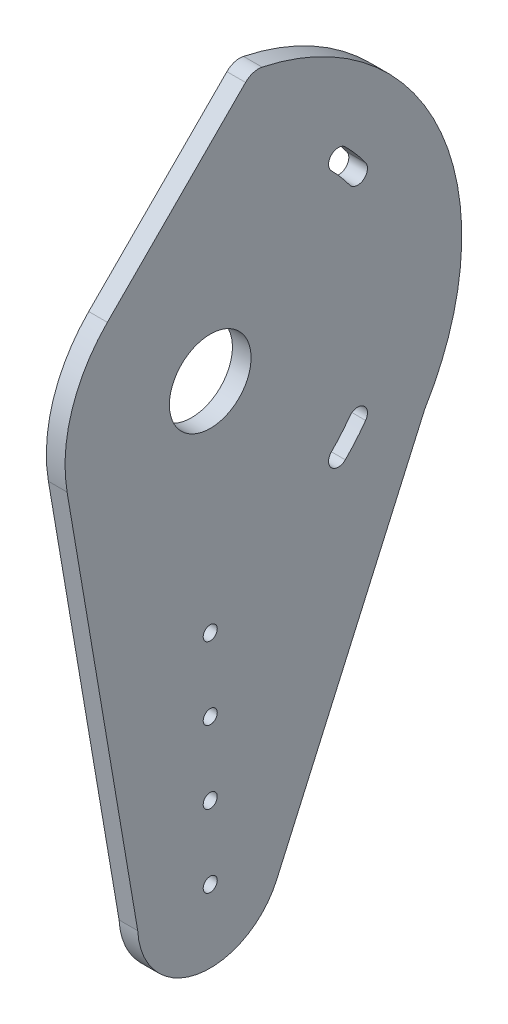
ISO-10303-21;
HEADER;
FILE_DESCRIPTION(('STEP AP214'),'2;1');
FILE_NAME('part.step','',(''),(''),'','','');
FILE_SCHEMA(('AUTOMOTIVE_DESIGN { 1 0 10303 214 1 1 1 1 }'));
ENDSEC;
DATA;
#1=APPLICATION_CONTEXT('core data for automotive mechanical design processes');
#2=APPLICATION_PROTOCOL_DEFINITION('international standard','automotive_design',2000,#1);
#3=PRODUCT_CONTEXT('',#1,'mechanical');
#4=PRODUCT('Part','Part','',(#3));
#5=PRODUCT_RELATED_PRODUCT_CATEGORY('part','',(#4));
#6=PRODUCT_DEFINITION_FORMATION('','',#4);
#7=PRODUCT_DEFINITION_CONTEXT('part definition',#1,'design');
#8=PRODUCT_DEFINITION('design','',#6,#7);
#9=PRODUCT_DEFINITION_SHAPE('','',#8);
#10=(LENGTH_UNIT() NAMED_UNIT(*) SI_UNIT(.MILLI.,.METRE.));
#11=(NAMED_UNIT(*) PLANE_ANGLE_UNIT() SI_UNIT($,.RADIAN.));
#12=(NAMED_UNIT(*) SI_UNIT($,.STERADIAN.) SOLID_ANGLE_UNIT());
#13=UNCERTAINTY_MEASURE_WITH_UNIT(LENGTH_MEASURE(1.E-05),#10,'distance_accuracy_value','');
#14=(GEOMETRIC_REPRESENTATION_CONTEXT(3) GLOBAL_UNCERTAINTY_ASSIGNED_CONTEXT((#13)) GLOBAL_UNIT_ASSIGNED_CONTEXT((#10,
#11,#12)) REPRESENTATION_CONTEXT('',''));
#15=CARTESIAN_POINT('',(0.,0.,0.));
#16=DIRECTION('',(0.,0.,1.));
#17=DIRECTION('',(1.,0.,0.));
#18=AXIS2_PLACEMENT_3D('',#15,#16,#17);
#19=CARTESIAN_POINT('',(6.5278,0.,0.));
#20=DIRECTION('',(1.,0.,0.));
#21=DIRECTION('',(0.,0.,-1.));
#22=AXIS2_PLACEMENT_3D('',#19,#20,#21);
#23=PLANE('',#22);
#24=CARTESIAN_POINT('',(6.5278,-152.4,0.));
#25=DIRECTION('',(1.,0.,0.));
#26=DIRECTION('',(0.,0.,-1.));
#27=AXIS2_PLACEMENT_3D('',#24,#25,#26);
#28=CIRCLE('',#27,2.45745);
#29=CARTESIAN_POINT('',(6.5278,-152.4,-2.45745000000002));
#30=VERTEX_POINT('',#29);
#31=EDGE_CURVE('E514',#30,#30,#28,.T.);
#32=ORIENTED_EDGE('',*,*,#31,.F.);
#33=EDGE_LOOP('',(#32));
#34=FACE_BOUND('',#33,.T.);
#35=CARTESIAN_POINT('',(6.5278,-127.,0.));
#36=DIRECTION('',(1.,0.,0.));
#37=DIRECTION('',(0.,0.,-1.));
#38=AXIS2_PLACEMENT_3D('',#35,#36,#37);
#39=CIRCLE('',#38,2.45745);
#40=CARTESIAN_POINT('',(6.5278,-127.,-2.45745000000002));
#41=VERTEX_POINT('',#40);
#42=EDGE_CURVE('E506',#41,#41,#39,.T.);
#43=ORIENTED_EDGE('',*,*,#42,.F.);
#44=EDGE_LOOP('',(#43));
#45=FACE_BOUND('',#44,.T.);
#46=CARTESIAN_POINT('',(6.5278,-101.6,0.));
#47=DIRECTION('',(1.,0.,0.));
#48=DIRECTION('',(0.,0.,-1.));
#49=AXIS2_PLACEMENT_3D('',#46,#47,#48);
#50=CIRCLE('',#49,2.45745);
#51=CARTESIAN_POINT('',(6.5278,-101.6,-2.45745000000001));
#52=VERTEX_POINT('',#51);
#53=EDGE_CURVE('E510',#52,#52,#50,.T.);
#54=ORIENTED_EDGE('',*,*,#53,.F.);
#55=EDGE_LOOP('',(#54));
#56=FACE_BOUND('',#55,.T.);
#57=CARTESIAN_POINT('',(6.5278,-76.2,0.));
#58=DIRECTION('',(1.,0.,0.));
#59=DIRECTION('',(0.,0.,-1.));
#60=AXIS2_PLACEMENT_3D('',#57,#58,#59);
#61=CIRCLE('',#60,2.45745);
#62=CARTESIAN_POINT('',(6.5278,-76.2,-2.45745000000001));
#63=VERTEX_POINT('',#62);
#64=EDGE_CURVE('E524',#63,#63,#61,.T.);
#65=ORIENTED_EDGE('',*,*,#64,.F.);
#66=EDGE_LOOP('',(#65));
#67=FACE_BOUND('',#66,.T.);
#68=CARTESIAN_POINT('',(6.5278,0.,0.));
#69=DIRECTION('',(1.,0.,0.));
#70=DIRECTION('',(0.,0.,-1.));
#71=AXIS2_PLACEMENT_3D('',#68,#69,#70);
#72=CIRCLE('',#71,87.988181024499);
#73=CARTESIAN_POINT('',(6.5278,-45.9358135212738,-75.0454597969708));
#74=VERTEX_POINT('',#73);
#75=CARTESIAN_POINT('',(6.5278,86.0935218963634,-18.1610981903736));
#76=VERTEX_POINT('',#75);
#77=EDGE_CURVE('E238',#74,#76,#72,.T.);
#78=ORIENTED_EDGE('',*,*,#77,.T.);
#79=CARTESIAN_POINT('',(6.5278,79.8802571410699,-16.8504338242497));
#80=DIRECTION('',(1.,0.,0.));
#81=DIRECTION('',(0.,0.,-1.));
#82=AXIS2_PLACEMENT_3D('',#79,#80,#81);
#83=CIRCLE('',#82,6.35);
#84=CARTESIAN_POINT('',(6.5278,84.3625830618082,-12.352517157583));
#85=VERTEX_POINT('',#84);
#86=EDGE_CURVE('E11',#76,#85,#83,.T.);
#87=ORIENTED_EDGE('',*,*,#86,.T.);
#88=DIRECTION('',(0.,-0.708333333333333,0.705878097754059));
#89=VECTOR('',#88,1.);
#90=CARTESIAN_POINT('',(6.5278,35.8586073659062,35.9833333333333));
#91=LINE('',#90,#89);
#92=CARTESIAN_POINT('',(6.5278,35.8586073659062,35.9833333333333));
#93=VERTEX_POINT('',#92);
#94=EDGE_CURVE('E240',#85,#93,#91,.T.);
#95=ORIENTED_EDGE('',*,*,#94,.T.);
#96=CARTESIAN_POINT('',(6.5278,0.,0.));
#97=DIRECTION('',(1.,0.,0.));
#98=DIRECTION('',(0.,0.,-1.));
#99=AXIS2_PLACEMENT_3D('',#96,#97,#98);
#100=CIRCLE('',#99,50.8);
#101=CARTESIAN_POINT('',(6.5278,-8.5217954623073,50.0801258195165));
#102=VERTEX_POINT('',#101);
#103=EDGE_CURVE('E228',#93,#102,#100,.T.);
#104=ORIENTED_EDGE('',*,*,#103,.T.);
#105=DIRECTION('',(0.,-0.985829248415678,-0.167751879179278));
#106=VECTOR('',#105,1.);
#107=CARTESIAN_POINT('',(6.5278,-8.5217954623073,50.0801258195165));
#108=LINE('',#107,#106);
#109=CARTESIAN_POINT('',(6.5278,-153.780327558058,25.3624662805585));
#110=VERTEX_POINT('',#109);
#111=EDGE_CURVE('E231',#102,#110,#108,.T.);
#112=ORIENTED_EDGE('',*,*,#111,.T.);
#113=CARTESIAN_POINT('',(6.5278,-152.4,0.));
#114=DIRECTION('',(1.,0.,0.));
#115=DIRECTION('',(0.,0.,-1.));
#116=AXIS2_PLACEMENT_3D('',#113,#114,#115);
#117=CIRCLE('',#116,25.4);
#118=CARTESIAN_POINT('',(6.5278,-162.70468956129,-23.2158000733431));
#119=VERTEX_POINT('',#118);
#120=EDGE_CURVE('E234',#110,#119,#117,.T.);
#121=ORIENTED_EDGE('',*,*,#120,.T.);
#122=DIRECTION('',(0.,0.914007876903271,-0.405696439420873));
#123=VECTOR('',#122,1.);
#124=CARTESIAN_POINT('',(6.5278,-162.70468956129,-23.2158000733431));
#125=LINE('',#124,#123);
#126=EDGE_CURVE('E236',#119,#74,#125,.T.);
#127=ORIENTED_EDGE('',*,*,#126,.T.);
#128=EDGE_LOOP('',(#78,#87,#95,#104,#112,#121,#127));
#129=FACE_BOUND('',#128,.T.);
#130=CARTESIAN_POINT('',(6.5278,0.,0.));
#131=DIRECTION('',(1.,0.,0.));
#132=DIRECTION('',(0.,0.,-1.));
#133=AXIS2_PLACEMENT_3D('',#130,#131,#132);
#134=CIRCLE('',#133,14.2875);
#135=CARTESIAN_POINT('',(6.5278,0.,14.2875));
#136=VERTEX_POINT('',#135);
#137=EDGE_CURVE('E221',#136,#136,#134,.T.);
#138=ORIENTED_EDGE('',*,*,#137,.F.);
#139=EDGE_LOOP('',(#138));
#140=FACE_BOUND('',#139,.T.);
#141=CARTESIAN_POINT('',(6.5278,0.,0.));
#142=DIRECTION('',(1.,0.,0.));
#143=DIRECTION('',(0.,0.,-1.));
#144=AXIS2_PLACEMENT_3D('',#141,#142,#143);
#145=CIRCLE('',#144,66.929);
#146=CARTESIAN_POINT('',(6.5278,39.0419166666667,-54.36193322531));
#147=VERTEX_POINT('',#146);
#148=CARTESIAN_POINT('',(6.5278,47.4080416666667,-47.2437152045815));
#149=VERTEX_POINT('',#148);
#150=EDGE_CURVE('E191',#147,#149,#145,.T.);
#151=ORIENTED_EDGE('',*,*,#150,.F.);
#152=CARTESIAN_POINT('',(6.5278,37.0416666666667,-51.5767867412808));
#153=DIRECTION('',(1.,0.,0.));
#154=DIRECTION('',(0.,0.,-1.));
#155=AXIS2_PLACEMENT_3D('',#152,#153,#154);
#156=CIRCLE('',#155,3.42900000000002);
#157=CARTESIAN_POINT('',(6.5278,35.0414166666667,-48.7916402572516));
#158=VERTEX_POINT('',#157);
#159=EDGE_CURVE('E189',#158,#147,#156,.T.);
#160=ORIENTED_EDGE('',*,*,#159,.F.);
#161=CARTESIAN_POINT('',(6.5278,0.,0.));
#162=DIRECTION('',(-1.,0.,0.));
#163=DIRECTION('',(0.,0.,-1.));
#164=AXIS2_PLACEMENT_3D('',#161,#162,#163);
#165=CIRCLE('',#164,60.071);
#166=CARTESIAN_POINT('',(6.5278,42.5502916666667,-42.4028032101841));
#167=VERTEX_POINT('',#166);
#168=EDGE_CURVE('E197',#167,#158,#165,.T.);
#169=ORIENTED_EDGE('',*,*,#168,.F.);
#170=CARTESIAN_POINT('',(6.5278,44.9791666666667,-44.8232592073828));
#171=DIRECTION('',(1.,0.,0.));
#172=DIRECTION('',(0.,0.,-1.));
#173=AXIS2_PLACEMENT_3D('',#170,#171,#172);
#174=CIRCLE('',#173,3.42900000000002);
#175=EDGE_CURVE('E194',#149,#167,#174,.T.);
#176=ORIENTED_EDGE('',*,*,#175,.F.);
#177=EDGE_LOOP('',(#151,#160,#169,#176));
#178=FACE_BOUND('',#177,.T.);
#179=CARTESIAN_POINT('',(6.5278,0.,0.));
#180=DIRECTION('',(-1.,0.,0.));
#181=DIRECTION('',(0.,0.,1.));
#182=AXIS2_PLACEMENT_3D('',#179,#180,#181);
#183=CIRCLE('',#182,60.0710000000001);
#184=CARTESIAN_POINT('',(6.5278,-35.0414166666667,-48.7916402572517));
#185=VERTEX_POINT('',#184);
#186=CARTESIAN_POINT('',(6.5278,-42.5502916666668,-42.4028032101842));
#187=VERTEX_POINT('',#186);
#188=EDGE_CURVE('E155',#185,#187,#183,.T.);
#189=ORIENTED_EDGE('',*,*,#188,.F.);
#190=CARTESIAN_POINT('',(6.5278,-37.0416666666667,-51.5767867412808));
#191=DIRECTION('',(1.,0.,0.));
#192=DIRECTION('',(0.,0.,1.));
#193=AXIS2_PLACEMENT_3D('',#190,#191,#192);
#194=CIRCLE('',#193,3.42899999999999);
#195=CARTESIAN_POINT('',(6.5278,-39.0419166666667,-54.36193322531));
#196=VERTEX_POINT('',#195);
#197=EDGE_CURVE('E145',#196,#185,#194,.T.);
#198=ORIENTED_EDGE('',*,*,#197,.F.);
#199=CARTESIAN_POINT('',(6.5278,0.,0.));
#200=DIRECTION('',(1.,0.,0.));
#201=DIRECTION('',(0.,0.,1.));
#202=AXIS2_PLACEMENT_3D('',#199,#200,#201);
#203=CIRCLE('',#202,66.9290000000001);
#204=CARTESIAN_POINT('',(6.5278,-47.4080416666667,-47.2437152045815));
#205=VERTEX_POINT('',#204);
#206=EDGE_CURVE('E170',#205,#196,#203,.T.);
#207=ORIENTED_EDGE('',*,*,#206,.F.);
#208=CARTESIAN_POINT('',(6.5278,-44.9791666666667,-44.8232592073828));
#209=DIRECTION('',(1.,0.,0.));
#210=DIRECTION('',(0.,0.,1.));
#211=AXIS2_PLACEMENT_3D('',#208,#209,#210);
#212=CIRCLE('',#211,3.42899999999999);
#213=EDGE_CURVE('E168',#187,#205,#212,.T.);
#214=ORIENTED_EDGE('',*,*,#213,.F.);
#215=EDGE_LOOP('',(#189,#198,#207,#214));
#216=FACE_BOUND('',#215,.T.);
#217=ADVANCED_FACE('F37',(#34,#45,#56,#67,#129,#140,#178,#216),#23,.T.);
#218=CARTESIAN_POINT('',(0.,0.,0.));
#219=DIRECTION('',(1.,0.,0.));
#220=DIRECTION('',(0.,0.,-1.));
#221=AXIS2_PLACEMENT_3D('',#218,#219,#220);
#222=PLANE('',#221);
#223=CARTESIAN_POINT('',(0.,-152.4,0.));
#224=DIRECTION('',(1.,0.,0.));
#225=DIRECTION('',(0.,0.,-1.));
#226=AXIS2_PLACEMENT_3D('',#223,#224,#225);
#227=CIRCLE('',#226,2.45745);
#228=CARTESIAN_POINT('',(0.,-152.4,-2.45745000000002));
#229=VERTEX_POINT('',#228);
#230=EDGE_CURVE('E507',#229,#229,#227,.T.);
#231=ORIENTED_EDGE('',*,*,#230,.T.);
#232=EDGE_LOOP('',(#231));
#233=FACE_BOUND('',#232,.T.);
#234=CARTESIAN_POINT('',(0.,-127.,0.));
#235=DIRECTION('',(1.,0.,0.));
#236=DIRECTION('',(0.,0.,-1.));
#237=AXIS2_PLACEMENT_3D('',#234,#235,#236);
#238=CIRCLE('',#237,2.45745);
#239=CARTESIAN_POINT('',(0.,-127.,-2.45745000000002));
#240=VERTEX_POINT('',#239);
#241=EDGE_CURVE('E503',#240,#240,#238,.T.);
#242=ORIENTED_EDGE('',*,*,#241,.T.);
#243=EDGE_LOOP('',(#242));
#244=FACE_BOUND('',#243,.T.);
#245=CARTESIAN_POINT('',(0.,-101.6,0.));
#246=DIRECTION('',(1.,0.,0.));
#247=DIRECTION('',(0.,0.,-1.));
#248=AXIS2_PLACEMENT_3D('',#245,#246,#247);
#249=CIRCLE('',#248,2.45745);
#250=CARTESIAN_POINT('',(0.,-101.6,-2.45745000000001));
#251=VERTEX_POINT('',#250);
#252=EDGE_CURVE('E520',#251,#251,#249,.T.);
#253=ORIENTED_EDGE('',*,*,#252,.T.);
#254=EDGE_LOOP('',(#253));
#255=FACE_BOUND('',#254,.T.);
#256=CARTESIAN_POINT('',(0.,-76.2,0.));
#257=DIRECTION('',(1.,0.,0.));
#258=DIRECTION('',(0.,0.,-1.));
#259=AXIS2_PLACEMENT_3D('',#256,#257,#258);
#260=CIRCLE('',#259,2.45745);
#261=CARTESIAN_POINT('',(0.,-76.2,-2.45745000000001));
#262=VERTEX_POINT('',#261);
#263=EDGE_CURVE('E178',#262,#262,#260,.T.);
#264=ORIENTED_EDGE('',*,*,#263,.T.);
#265=EDGE_LOOP('',(#264));
#266=FACE_BOUND('',#265,.T.);
#267=CARTESIAN_POINT('',(0.,37.0416666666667,-51.5767867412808));
#268=DIRECTION('',(1.,0.,0.));
#269=DIRECTION('',(0.,0.,-1.));
#270=AXIS2_PLACEMENT_3D('',#267,#268,#269);
#271=CIRCLE('',#270,3.42900000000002);
#272=CARTESIAN_POINT('',(0.,35.0414166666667,-48.7916402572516));
#273=VERTEX_POINT('',#272);
#274=CARTESIAN_POINT('',(0.,39.0419166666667,-54.36193322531));
#275=VERTEX_POINT('',#274);
#276=EDGE_CURVE('E163',#273,#275,#271,.T.);
#277=ORIENTED_EDGE('',*,*,#276,.T.);
#278=CARTESIAN_POINT('',(0.,0.,0.));
#279=DIRECTION('',(1.,0.,0.));
#280=DIRECTION('',(0.,0.,-1.));
#281=AXIS2_PLACEMENT_3D('',#278,#279,#280);
#282=CIRCLE('',#281,66.929);
#283=CARTESIAN_POINT('',(0.,47.4080416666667,-47.2437152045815));
#284=VERTEX_POINT('',#283);
#285=EDGE_CURVE('E202',#275,#284,#282,.T.);
#286=ORIENTED_EDGE('',*,*,#285,.T.);
#287=CARTESIAN_POINT('',(0.,44.9791666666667,-44.8232592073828));
#288=DIRECTION('',(1.,0.,0.));
#289=DIRECTION('',(0.,0.,-1.));
#290=AXIS2_PLACEMENT_3D('',#287,#288,#289);
#291=CIRCLE('',#290,3.42900000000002);
#292=CARTESIAN_POINT('',(0.,42.5502916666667,-42.4028032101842));
#293=VERTEX_POINT('',#292);
#294=EDGE_CURVE('E206',#284,#293,#291,.T.);
#295=ORIENTED_EDGE('',*,*,#294,.T.);
#296=CARTESIAN_POINT('',(0.,0.,0.));
#297=DIRECTION('',(-1.,0.,0.));
#298=DIRECTION('',(0.,0.,-1.));
#299=AXIS2_PLACEMENT_3D('',#296,#297,#298);
#300=CIRCLE('',#299,60.071);
#301=EDGE_CURVE('E192',#293,#273,#300,.T.);
#302=ORIENTED_EDGE('',*,*,#301,.T.);
#303=EDGE_LOOP('',(#277,#286,#295,#302));
#304=FACE_BOUND('',#303,.T.);
#305=DIRECTION('',(0.,-0.708333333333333,0.705878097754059));
#306=VECTOR('',#305,1.);
#307=CARTESIAN_POINT('',(0.,35.8586073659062,35.9833333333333));
#308=LINE('',#307,#306);
#309=CARTESIAN_POINT('',(0.,84.3625830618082,-12.352517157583));
#310=VERTEX_POINT('',#309);
#311=CARTESIAN_POINT('',(0.,35.8586073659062,35.9833333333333));
#312=VERTEX_POINT('',#311);
#313=EDGE_CURVE('E232',#310,#312,#308,.T.);
#314=ORIENTED_EDGE('',*,*,#313,.F.);
#315=CARTESIAN_POINT('',(0.,79.8802571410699,-16.8504338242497));
#316=DIRECTION('',(1.,0.,0.));
#317=DIRECTION('',(0.,0.,-1.));
#318=AXIS2_PLACEMENT_3D('',#315,#316,#317);
#319=CIRCLE('',#318,6.35);
#320=CARTESIAN_POINT('',(0.,86.0935218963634,-18.1610981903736));
#321=VERTEX_POINT('',#320);
#322=EDGE_CURVE('E59',#310,#321,#319,.F.);
#323=ORIENTED_EDGE('',*,*,#322,.T.);
#324=CARTESIAN_POINT('',(0.,0.,0.));
#325=DIRECTION('',(1.,0.,0.));
#326=DIRECTION('',(0.,0.,-1.));
#327=AXIS2_PLACEMENT_3D('',#324,#325,#326);
#328=CIRCLE('',#327,87.988181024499);
#329=CARTESIAN_POINT('',(0.,-45.9358135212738,-75.0454597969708));
#330=VERTEX_POINT('',#329);
#331=EDGE_CURVE('E252',#330,#321,#328,.T.);
#332=ORIENTED_EDGE('',*,*,#331,.F.);
#333=DIRECTION('',(0.,0.914007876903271,-0.405696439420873));
#334=VECTOR('',#333,1.);
#335=CARTESIAN_POINT('',(0.,-162.70468956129,-23.2158000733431));
#336=LINE('',#335,#334);
#337=CARTESIAN_POINT('',(0.,-162.70468956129,-23.2158000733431));
#338=VERTEX_POINT('',#337);
#339=EDGE_CURVE('E250',#338,#330,#336,.T.);
#340=ORIENTED_EDGE('',*,*,#339,.F.);
#341=CARTESIAN_POINT('',(0.,-152.4,0.));
#342=DIRECTION('',(1.,0.,0.));
#343=DIRECTION('',(0.,0.,-1.));
#344=AXIS2_PLACEMENT_3D('',#341,#342,#343);
#345=CIRCLE('',#344,25.4);
#346=CARTESIAN_POINT('',(0.,-153.780327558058,25.3624662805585));
#347=VERTEX_POINT('',#346);
#348=EDGE_CURVE('E247',#347,#338,#345,.T.);
#349=ORIENTED_EDGE('',*,*,#348,.F.);
#350=DIRECTION('',(0.,-0.985829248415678,-0.167751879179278));
#351=VECTOR('',#350,1.);
#352=CARTESIAN_POINT('',(0.,-78.5065168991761,38.1713002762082));
#353=LINE('',#352,#351);
#354=CARTESIAN_POINT('',(0.,-8.5217954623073,50.0801258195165));
#355=VERTEX_POINT('',#354);
#356=EDGE_CURVE('E245',#355,#347,#353,.T.);
#357=ORIENTED_EDGE('',*,*,#356,.F.);
#358=CARTESIAN_POINT('',(0.,0.,0.));
#359=DIRECTION('',(1.,0.,0.));
#360=DIRECTION('',(0.,0.,-1.));
#361=AXIS2_PLACEMENT_3D('',#358,#359,#360);
#362=CIRCLE('',#361,50.8);
#363=EDGE_CURVE('E224',#312,#355,#362,.T.);
#364=ORIENTED_EDGE('',*,*,#363,.F.);
#365=EDGE_LOOP('',(#314,#323,#332,#340,#349,#357,#364));
#366=FACE_BOUND('',#365,.T.);
#367=CARTESIAN_POINT('',(0.,0.,0.));
#368=DIRECTION('',(1.,0.,0.));
#369=DIRECTION('',(0.,0.,-1.));
#370=AXIS2_PLACEMENT_3D('',#367,#368,#369);
#371=CIRCLE('',#370,14.2875);
#372=CARTESIAN_POINT('',(0.,0.,14.2875));
#373=VERTEX_POINT('',#372);
#374=EDGE_CURVE('E220',#373,#373,#371,.T.);
#375=ORIENTED_EDGE('',*,*,#374,.T.);
#376=EDGE_LOOP('',(#375));
#377=FACE_BOUND('',#376,.T.);
#378=CARTESIAN_POINT('',(0.,-37.0416666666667,-51.5767867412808));
#379=DIRECTION('',(1.,0.,0.));
#380=DIRECTION('',(0.,0.,1.));
#381=AXIS2_PLACEMENT_3D('',#378,#379,#380);
#382=CIRCLE('',#381,3.42899999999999);
#383=CARTESIAN_POINT('',(0.,-39.0419166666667,-54.36193322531));
#384=VERTEX_POINT('',#383);
#385=CARTESIAN_POINT('',(0.,-35.0414166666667,-48.7916402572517));
#386=VERTEX_POINT('',#385);
#387=EDGE_CURVE('E175',#384,#386,#382,.T.);
#388=ORIENTED_EDGE('',*,*,#387,.T.);
#389=CARTESIAN_POINT('',(0.,0.,0.));
#390=DIRECTION('',(-1.,0.,0.));
#391=DIRECTION('',(0.,0.,1.));
#392=AXIS2_PLACEMENT_3D('',#389,#390,#391);
#393=CIRCLE('',#392,60.0710000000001);
#394=CARTESIAN_POINT('',(0.,-42.5502916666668,-42.4028032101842));
#395=VERTEX_POINT('',#394);
#396=EDGE_CURVE('E162',#386,#395,#393,.T.);
#397=ORIENTED_EDGE('',*,*,#396,.T.);
#398=CARTESIAN_POINT('',(0.,-44.9791666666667,-44.8232592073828));
#399=DIRECTION('',(1.,0.,0.));
#400=DIRECTION('',(0.,0.,1.));
#401=AXIS2_PLACEMENT_3D('',#398,#399,#400);
#402=CIRCLE('',#401,3.42899999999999);
#403=CARTESIAN_POINT('',(0.,-47.4080416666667,-47.2437152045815));
#404=VERTEX_POINT('',#403);
#405=EDGE_CURVE('E180',#395,#404,#402,.T.);
#406=ORIENTED_EDGE('',*,*,#405,.T.);
#407=CARTESIAN_POINT('',(0.,0.,0.));
#408=DIRECTION('',(1.,0.,0.));
#409=DIRECTION('',(0.,0.,1.));
#410=AXIS2_PLACEMENT_3D('',#407,#408,#409);
#411=CIRCLE('',#410,66.9290000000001);
#412=EDGE_CURVE('E156',#404,#384,#411,.T.);
#413=ORIENTED_EDGE('',*,*,#412,.T.);
#414=EDGE_LOOP('',(#388,#397,#406,#413));
#415=FACE_BOUND('',#414,.T.);
#416=ADVANCED_FACE('F280',(#233,#244,#255,#266,#304,#366,#377,#415),#222,.F.);
#417=CARTESIAN_POINT('',(6.5278,0.,0.));
#418=DIRECTION('',(-1.,0.,0.));
#419=DIRECTION('',(0.,0.,1.));
#420=AXIS2_PLACEMENT_3D('',#417,#418,#419);
#421=CYLINDRICAL_SURFACE('',#420,50.8);
#422=ORIENTED_EDGE('',*,*,#363,.T.);
#423=DIRECTION('',(-1.,0.,0.));
#424=VECTOR('',#423,1.);
#425=CARTESIAN_POINT('',(6.5278,-8.5217954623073,50.0801258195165));
#426=LINE('',#425,#424);
#427=EDGE_CURVE('E266',#102,#355,#426,.T.);
#428=ORIENTED_EDGE('',*,*,#427,.F.);
#429=ORIENTED_EDGE('',*,*,#103,.F.);
#430=DIRECTION('',(-1.,0.,0.));
#431=VECTOR('',#430,1.);
#432=CARTESIAN_POINT('',(6.5278,35.8586073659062,35.9833333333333));
#433=LINE('',#432,#431);
#434=EDGE_CURVE('E242',#93,#312,#433,.T.);
#435=ORIENTED_EDGE('',*,*,#434,.T.);
#436=EDGE_LOOP('',(#422,#428,#429,#435));
#437=FACE_BOUND('',#436,.T.);
#438=ADVANCED_FACE('F285',(#437),#421,.T.);
#439=CARTESIAN_POINT('',(6.5278,-78.5065168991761,38.1713002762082));
#440=DIRECTION('',(0.,0.167751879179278,-0.985829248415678));
#441=DIRECTION('',(0.,0.985829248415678,0.167751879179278));
#442=AXIS2_PLACEMENT_3D('',#439,#440,#441);
#443=PLANE('',#442);
#444=ORIENTED_EDGE('',*,*,#356,.T.);
#445=DIRECTION('',(-1.,0.,0.));
#446=VECTOR('',#445,1.);
#447=CARTESIAN_POINT('',(6.5278,-153.780327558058,25.3624662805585));
#448=LINE('',#447,#446);
#449=EDGE_CURVE('E263',#110,#347,#448,.T.);
#450=ORIENTED_EDGE('',*,*,#449,.F.);
#451=ORIENTED_EDGE('',*,*,#111,.F.);
#452=ORIENTED_EDGE('',*,*,#427,.T.);
#453=EDGE_LOOP('',(#444,#450,#451,#452));
#454=FACE_BOUND('',#453,.T.);
#455=ADVANCED_FACE('F324',(#454),#443,.F.);
#456=CARTESIAN_POINT('',(6.5278,-152.4,0.));
#457=DIRECTION('',(-1.,0.,0.));
#458=DIRECTION('',(0.,0.,1.));
#459=AXIS2_PLACEMENT_3D('',#456,#457,#458);
#460=CYLINDRICAL_SURFACE('',#459,25.4);
#461=ORIENTED_EDGE('',*,*,#348,.T.);
#462=DIRECTION('',(-1.,0.,0.));
#463=VECTOR('',#462,1.);
#464=CARTESIAN_POINT('',(6.5278,-162.70468956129,-23.2158000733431));
#465=LINE('',#464,#463);
#466=EDGE_CURVE('E260',#119,#338,#465,.T.);
#467=ORIENTED_EDGE('',*,*,#466,.F.);
#468=ORIENTED_EDGE('',*,*,#120,.F.);
#469=ORIENTED_EDGE('',*,*,#449,.T.);
#470=EDGE_LOOP('',(#461,#467,#468,#469));
#471=FACE_BOUND('',#470,.T.);
#472=ADVANCED_FACE('F320',(#471),#460,.T.);
#473=CARTESIAN_POINT('',(6.5278,-162.70468956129,-23.2158000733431));
#474=DIRECTION('',(0.,0.405696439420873,0.914007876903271));
#475=DIRECTION('',(0.,-0.914007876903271,0.405696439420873));
#476=AXIS2_PLACEMENT_3D('',#473,#474,#475);
#477=PLANE('',#476);
#478=ORIENTED_EDGE('',*,*,#339,.T.);
#479=DIRECTION('',(-1.,0.,0.));
#480=VECTOR('',#479,1.);
#481=CARTESIAN_POINT('',(6.5278,-45.9358135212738,-75.0454597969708));
#482=LINE('',#481,#480);
#483=EDGE_CURVE('E257',#74,#330,#482,.T.);
#484=ORIENTED_EDGE('',*,*,#483,.F.);
#485=ORIENTED_EDGE('',*,*,#126,.F.);
#486=ORIENTED_EDGE('',*,*,#466,.T.);
#487=EDGE_LOOP('',(#478,#484,#485,#486));
#488=FACE_BOUND('',#487,.T.);
#489=ADVANCED_FACE('F317',(#488),#477,.F.);
#490=CARTESIAN_POINT('',(6.5278,0.,0.));
#491=DIRECTION('',(-1.,0.,0.));
#492=DIRECTION('',(0.,0.,1.));
#493=AXIS2_PLACEMENT_3D('',#490,#491,#492);
#494=CYLINDRICAL_SURFACE('',#493,87.988181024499);
#495=ORIENTED_EDGE('',*,*,#331,.T.);
#496=DIRECTION('',(-1.,0.,0.));
#497=VECTOR('',#496,1.);
#498=CARTESIAN_POINT('',(6.5278,86.0935218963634,-18.1610981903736));
#499=LINE('',#498,#497);
#500=EDGE_CURVE('E45',#321,#76,#499,.F.);
#501=ORIENTED_EDGE('',*,*,#500,.T.);
#502=ORIENTED_EDGE('',*,*,#77,.F.);
#503=ORIENTED_EDGE('',*,*,#483,.T.);
#504=EDGE_LOOP('',(#495,#501,#502,#503));
#505=FACE_BOUND('',#504,.T.);
#506=ADVANCED_FACE('F314',(#505),#494,.T.);
#507=CARTESIAN_POINT('',(6.5278,35.8586073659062,35.9833333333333));
#508=DIRECTION('',(0.,-0.705878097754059,-0.708333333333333));
#509=DIRECTION('',(0.,0.708333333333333,-0.705878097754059));
#510=AXIS2_PLACEMENT_3D('',#507,#508,#509);
#511=PLANE('',#510);
#512=ORIENTED_EDGE('',*,*,#94,.F.);
#513=DIRECTION('',(-1.,0.,0.));
#514=VECTOR('',#513,1.);
#515=CARTESIAN_POINT('',(6.5278,84.3625830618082,-12.352517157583));
#516=LINE('',#515,#514);
#517=EDGE_CURVE('E269',#85,#310,#516,.T.);
#518=ORIENTED_EDGE('',*,*,#517,.T.);
#519=ORIENTED_EDGE('',*,*,#313,.T.);
#520=ORIENTED_EDGE('',*,*,#434,.F.);
#521=EDGE_LOOP('',(#512,#518,#519,#520));
#522=FACE_BOUND('',#521,.T.);
#523=ADVANCED_FACE('F275',(#522),#511,.F.);
#524=CARTESIAN_POINT('',(6.5278,0.,0.));
#525=DIRECTION('',(-1.,0.,0.));
#526=DIRECTION('',(0.,0.,1.));
#527=AXIS2_PLACEMENT_3D('',#524,#525,#526);
#528=CYLINDRICAL_SURFACE('',#527,14.2875);
#529=CARTESIAN_POINT('',(6.5278,0.,14.2875));
#530=CARTESIAN_POINT('',(6.45980208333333,0.,14.2875));
#531=CARTESIAN_POINT('',(6.39180416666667,0.,14.2875));
#532=CARTESIAN_POINT('',(6.25580833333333,0.,14.2875));
#533=CARTESIAN_POINT('',(6.18781041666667,0.,14.2875));
#534=CARTESIAN_POINT('',(6.05181458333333,0.,14.2875));
#535=CARTESIAN_POINT('',(5.98381666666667,0.,14.2875));
#536=CARTESIAN_POINT('',(5.84782083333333,0.,14.2875));
#537=CARTESIAN_POINT('',(5.77982291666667,0.,14.2875));
#538=CARTESIAN_POINT('',(5.64382708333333,0.,14.2875));
#539=CARTESIAN_POINT('',(5.57582916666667,0.,14.2875));
#540=CARTESIAN_POINT('',(5.43983333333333,0.,14.2875));
#541=CARTESIAN_POINT('',(5.37183541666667,0.,14.2875));
#542=CARTESIAN_POINT('',(5.23583958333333,0.,14.2875));
#543=CARTESIAN_POINT('',(5.16784166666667,0.,14.2875));
#544=CARTESIAN_POINT('',(5.03184583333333,0.,14.2875));
#545=CARTESIAN_POINT('',(4.96384791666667,0.,14.2875));
#546=CARTESIAN_POINT('',(4.82785208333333,0.,14.2875));
#547=CARTESIAN_POINT('',(4.75985416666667,0.,14.2875));
#548=CARTESIAN_POINT('',(4.62385833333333,0.,14.2875));
#549=CARTESIAN_POINT('',(4.55586041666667,0.,14.2875));
#550=CARTESIAN_POINT('',(4.41986458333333,0.,14.2875));
#551=CARTESIAN_POINT('',(4.35186666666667,0.,14.2875));
#552=CARTESIAN_POINT('',(4.21587083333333,0.,14.2875));
#553=CARTESIAN_POINT('',(4.14787291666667,0.,14.2875));
#554=CARTESIAN_POINT('',(4.01187708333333,0.,14.2875));
#555=CARTESIAN_POINT('',(3.94387916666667,0.,14.2875));
#556=CARTESIAN_POINT('',(3.80788333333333,0.,14.2875));
#557=CARTESIAN_POINT('',(3.73988541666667,0.,14.2875));
#558=CARTESIAN_POINT('',(3.60388958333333,0.,14.2875));
#559=CARTESIAN_POINT('',(3.53589166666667,0.,14.2875));
#560=CARTESIAN_POINT('',(3.39989583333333,0.,14.2875));
#561=CARTESIAN_POINT('',(3.33189791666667,0.,14.2875));
#562=CARTESIAN_POINT('',(3.19590208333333,0.,14.2875));
#563=CARTESIAN_POINT('',(3.12790416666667,0.,14.2875));
#564=CARTESIAN_POINT('',(2.99190833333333,0.,14.2875));
#565=CARTESIAN_POINT('',(2.92391041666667,0.,14.2875));
#566=CARTESIAN_POINT('',(2.78791458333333,0.,14.2875));
#567=CARTESIAN_POINT('',(2.71991666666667,0.,14.2875));
#568=CARTESIAN_POINT('',(2.58392083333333,0.,14.2875));
#569=CARTESIAN_POINT('',(2.51592291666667,0.,14.2875));
#570=CARTESIAN_POINT('',(2.37992708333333,0.,14.2875));
#571=CARTESIAN_POINT('',(2.31192916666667,0.,14.2875));
#572=CARTESIAN_POINT('',(2.17593333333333,0.,14.2875));
#573=CARTESIAN_POINT('',(2.10793541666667,0.,14.2875));
#574=CARTESIAN_POINT('',(1.97193958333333,0.,14.2875));
#575=CARTESIAN_POINT('',(1.90394166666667,0.,14.2875));
#576=CARTESIAN_POINT('',(1.76794583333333,0.,14.2875));
#577=CARTESIAN_POINT('',(1.69994791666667,0.,14.2875));
#578=CARTESIAN_POINT('',(1.56395208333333,0.,14.2875));
#579=CARTESIAN_POINT('',(1.49595416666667,0.,14.2875));
#580=CARTESIAN_POINT('',(1.35995833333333,0.,14.2875));
#581=CARTESIAN_POINT('',(1.29196041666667,0.,14.2875));
#582=CARTESIAN_POINT('',(1.15596458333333,0.,14.2875));
#583=CARTESIAN_POINT('',(1.08796666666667,0.,14.2875));
#584=CARTESIAN_POINT('',(0.951970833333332,0.,14.2875));
#585=CARTESIAN_POINT('',(0.883972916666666,0.,14.2875));
#586=CARTESIAN_POINT('',(0.747977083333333,0.,14.2875));
#587=CARTESIAN_POINT('',(0.679979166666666,0.,14.2875));
#588=CARTESIAN_POINT('',(0.543983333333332,0.,14.2875));
#589=CARTESIAN_POINT('',(0.475985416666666,0.,14.2875));
#590=CARTESIAN_POINT('',(0.339989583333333,0.,14.2875));
#591=CARTESIAN_POINT('',(0.271991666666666,0.,14.2875));
#592=CARTESIAN_POINT('',(0.135995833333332,0.,14.2875));
#593=CARTESIAN_POINT('',(0.0679979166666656,0.,14.2875));
#594=CARTESIAN_POINT('',(0.,0.,14.2875));
#595=B_SPLINE_CURVE_WITH_KNOTS('',3,(#529,#530,#531,#532,#533,#534,#535,#536,#537,#538,#539,
#540,#541,#542,#543,#544,#545,#546,#547,#548,#549,#550,#551,#552,#553,#554,#555,#556,#557,#558,
#559,#560,#561,#562,#563,#564,#565,#566,#567,#568,#569,#570,#571,#572,#573,#574,#575,#576,#577,
#578,#579,#580,#581,#582,#583,#584,#585,#586,#587,#588,#589,#590,#591,#592,#593,#594),
.UNSPECIFIED.,.F.,.F.,(4,2,2,2,2,2,2,2,2,2,2,2,2,2,2,2,2,2,2,2,2,2,2,2,2,2,2,2,2,2,2,2,4),(0.,
0.203993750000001,0.407987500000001,0.611981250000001,0.815975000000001,1.01996875,1.2239625,
1.42795625,1.63195,1.83594375,2.0399375,2.24393125,2.447925,2.65191875,2.8559125,3.05990625,
3.2639,3.46789375,3.6718875,3.87588125,4.079875,4.28386875,4.4878625,4.69185625,4.89585,
5.09984375,5.3038375,5.50783125,5.711825,5.91581875,6.1198125,6.32380625,6.5278),.UNSPECIFIED.);
#596=EDGE_CURVE('BSEAM309',#136,#373,#595,.T.);
#597=ORIENTED_EDGE('',*,*,#137,.T.);
#598=ORIENTED_EDGE('',*,*,#374,.F.);
#599=ORIENTED_EDGE('',*,*,#596,.T.);
#600=ORIENTED_EDGE('',*,*,#596,.F.);
#601=EDGE_LOOP('',(#597,#599,#598,#600));
#602=FACE_BOUND('',#601,.T.);
#603=ADVANCED_FACE('F309',(#602),#528,.F.);
#604=CARTESIAN_POINT('',(6.5278,37.0416666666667,-51.5767867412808));
#605=DIRECTION('',(-1.,0.,0.));
#606=DIRECTION('',(0.,0.,1.));
#607=AXIS2_PLACEMENT_3D('',#604,#605,#606);
#608=CYLINDRICAL_SURFACE('',#607,3.42900000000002);
#609=ORIENTED_EDGE('',*,*,#276,.F.);
#610=DIRECTION('',(-1.,0.,0.));
#611=VECTOR('',#610,1.);
#612=CARTESIAN_POINT('',(6.5278,35.0414166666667,-48.7916402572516));
#613=LINE('',#612,#611);
#614=EDGE_CURVE('E199',#158,#273,#613,.T.);
#615=ORIENTED_EDGE('',*,*,#614,.F.);
#616=ORIENTED_EDGE('',*,*,#159,.T.);
#617=DIRECTION('',(-1.,0.,0.));
#618=VECTOR('',#617,1.);
#619=CARTESIAN_POINT('',(6.5278,39.0419166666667,-54.36193322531));
#620=LINE('',#619,#618);
#621=EDGE_CURVE('E217',#147,#275,#620,.T.);
#622=ORIENTED_EDGE('',*,*,#621,.T.);
#623=EDGE_LOOP('',(#609,#615,#616,#622));
#624=FACE_BOUND('',#623,.T.);
#625=ADVANCED_FACE('F359',(#624),#608,.F.);
#626=CARTESIAN_POINT('',(6.5278,0.,0.));
#627=DIRECTION('',(-1.,0.,0.));
#628=DIRECTION('',(0.,0.,1.));
#629=AXIS2_PLACEMENT_3D('',#626,#627,#628);
#630=CYLINDRICAL_SURFACE('',#629,66.929);
#631=ORIENTED_EDGE('',*,*,#285,.F.);
#632=ORIENTED_EDGE('',*,*,#621,.F.);
#633=ORIENTED_EDGE('',*,*,#150,.T.);
#634=DIRECTION('',(-1.,0.,0.));
#635=VECTOR('',#634,1.);
#636=CARTESIAN_POINT('',(6.5278,47.4080416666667,-47.2437152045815));
#637=LINE('',#636,#635);
#638=EDGE_CURVE('E215',#149,#284,#637,.T.);
#639=ORIENTED_EDGE('',*,*,#638,.T.);
#640=EDGE_LOOP('',(#631,#632,#633,#639));
#641=FACE_BOUND('',#640,.T.);
#642=ADVANCED_FACE('F366',(#641),#630,.F.);
#643=CARTESIAN_POINT('',(6.5278,44.9791666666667,-44.8232592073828));
#644=DIRECTION('',(-1.,0.,0.));
#645=DIRECTION('',(0.,0.,1.));
#646=AXIS2_PLACEMENT_3D('',#643,#644,#645);
#647=CYLINDRICAL_SURFACE('',#646,3.42900000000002);
#648=ORIENTED_EDGE('',*,*,#294,.F.);
#649=ORIENTED_EDGE('',*,*,#638,.F.);
#650=ORIENTED_EDGE('',*,*,#175,.T.);
#651=DIRECTION('',(-1.,0.,0.));
#652=VECTOR('',#651,1.);
#653=CARTESIAN_POINT('',(6.5278,42.5502916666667,-42.4028032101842));
#654=LINE('',#653,#652);
#655=EDGE_CURVE('E213',#167,#293,#654,.T.);
#656=ORIENTED_EDGE('',*,*,#655,.T.);
#657=EDGE_LOOP('',(#648,#649,#650,#656));
#658=FACE_BOUND('',#657,.T.);
#659=ADVANCED_FACE('F373',(#658),#647,.F.);
#660=CARTESIAN_POINT('',(6.5278,0.,0.));
#661=DIRECTION('',(-1.,0.,0.));
#662=DIRECTION('',(0.,0.,1.));
#663=AXIS2_PLACEMENT_3D('',#660,#661,#662);
#664=CYLINDRICAL_SURFACE('',#663,60.071);
#665=ORIENTED_EDGE('',*,*,#301,.F.);
#666=ORIENTED_EDGE('',*,*,#655,.F.);
#667=ORIENTED_EDGE('',*,*,#168,.T.);
#668=ORIENTED_EDGE('',*,*,#614,.T.);
#669=EDGE_LOOP('',(#665,#666,#667,#668));
#670=FACE_BOUND('',#669,.T.);
#671=ADVANCED_FACE('F381',(#670),#664,.T.);
#672=CARTESIAN_POINT('',(6.5278,-37.0416666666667,-51.5767867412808));
#673=DIRECTION('',(-1.,0.,0.));
#674=DIRECTION('',(0.,0.,1.));
#675=AXIS2_PLACEMENT_3D('',#672,#673,#674);
#676=CYLINDRICAL_SURFACE('',#675,3.42899999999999);
#677=ORIENTED_EDGE('',*,*,#387,.F.);
#678=DIRECTION('',(-1.,0.,0.));
#679=VECTOR('',#678,1.);
#680=CARTESIAN_POINT('',(6.5278,-39.0419166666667,-54.36193322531));
#681=LINE('',#680,#679);
#682=EDGE_CURVE('E151',#196,#384,#681,.T.);
#683=ORIENTED_EDGE('',*,*,#682,.F.);
#684=ORIENTED_EDGE('',*,*,#197,.T.);
#685=DIRECTION('',(-1.,0.,0.));
#686=VECTOR('',#685,1.);
#687=CARTESIAN_POINT('',(6.5278,-35.0414166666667,-48.7916402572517));
#688=LINE('',#687,#686);
#689=EDGE_CURVE('E148',#185,#386,#688,.T.);
#690=ORIENTED_EDGE('',*,*,#689,.T.);
#691=EDGE_LOOP('',(#677,#683,#684,#690));
#692=FACE_BOUND('',#691,.T.);
#693=ADVANCED_FACE('F147',(#692),#676,.F.);
#694=CARTESIAN_POINT('',(6.5278,0.,0.));
#695=DIRECTION('',(-1.,0.,0.));
#696=DIRECTION('',(0.,0.,1.));
#697=AXIS2_PLACEMENT_3D('',#694,#695,#696);
#698=CYLINDRICAL_SURFACE('',#697,60.0710000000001);
#699=ORIENTED_EDGE('',*,*,#396,.F.);
#700=ORIENTED_EDGE('',*,*,#689,.F.);
#701=ORIENTED_EDGE('',*,*,#188,.T.);
#702=DIRECTION('',(-1.,0.,0.));
#703=VECTOR('',#702,1.);
#704=CARTESIAN_POINT('',(6.5278,-42.5502916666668,-42.4028032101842));
#705=LINE('',#704,#703);
#706=EDGE_CURVE('E164',#187,#395,#705,.T.);
#707=ORIENTED_EDGE('',*,*,#706,.T.);
#708=EDGE_LOOP('',(#699,#700,#701,#707));
#709=FACE_BOUND('',#708,.T.);
#710=ADVANCED_FACE('F159',(#709),#698,.T.);
#711=CARTESIAN_POINT('',(6.5278,-44.9791666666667,-44.8232592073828));
#712=DIRECTION('',(-1.,0.,0.));
#713=DIRECTION('',(0.,0.,1.));
#714=AXIS2_PLACEMENT_3D('',#711,#712,#713);
#715=CYLINDRICAL_SURFACE('',#714,3.42899999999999);
#716=ORIENTED_EDGE('',*,*,#405,.F.);
#717=ORIENTED_EDGE('',*,*,#706,.F.);
#718=ORIENTED_EDGE('',*,*,#213,.T.);
#719=DIRECTION('',(-1.,0.,0.));
#720=VECTOR('',#719,1.);
#721=CARTESIAN_POINT('',(6.5278,-47.4080416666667,-47.2437152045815));
#722=LINE('',#721,#720);
#723=EDGE_CURVE('E186',#205,#404,#722,.T.);
#724=ORIENTED_EDGE('',*,*,#723,.T.);
#725=EDGE_LOOP('',(#716,#717,#718,#724));
#726=FACE_BOUND('',#725,.T.);
#727=ADVANCED_FACE('F402',(#726),#715,.F.);
#728=CARTESIAN_POINT('',(6.5278,0.,0.));
#729=DIRECTION('',(-1.,0.,0.));
#730=DIRECTION('',(0.,0.,1.));
#731=AXIS2_PLACEMENT_3D('',#728,#729,#730);
#732=CYLINDRICAL_SURFACE('',#731,66.9290000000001);
#733=ORIENTED_EDGE('',*,*,#412,.F.);
#734=ORIENTED_EDGE('',*,*,#723,.F.);
#735=ORIENTED_EDGE('',*,*,#206,.T.);
#736=ORIENTED_EDGE('',*,*,#682,.T.);
#737=EDGE_LOOP('',(#733,#734,#735,#736));
#738=FACE_BOUND('',#737,.T.);
#739=ADVANCED_FACE('F409',(#738),#732,.F.);
#740=CARTESIAN_POINT('',(6.5278,-76.2,0.));
#741=DIRECTION('',(1.,0.,0.));
#742=DIRECTION('',(0.,0.,-1.));
#743=AXIS2_PLACEMENT_3D('',#740,#741,#742);
#744=CYLINDRICAL_SURFACE('',#743,2.45745);
#745=ORIENTED_EDGE('',*,*,#263,.F.);
#746=EDGE_LOOP('',(#745));
#747=FACE_BOUND('',#746,.T.);
#748=ORIENTED_EDGE('',*,*,#64,.T.);
#749=EDGE_LOOP('',(#748));
#750=FACE_BOUND('',#749,.T.);
#751=ADVANCED_FACE('F417',(#747,#750),#744,.F.);
#752=CARTESIAN_POINT('',(6.5278,-101.6,0.));
#753=DIRECTION('',(1.,0.,0.));
#754=DIRECTION('',(0.,0.,-1.));
#755=AXIS2_PLACEMENT_3D('',#752,#753,#754);
#756=CYLINDRICAL_SURFACE('',#755,2.45745);
#757=ORIENTED_EDGE('',*,*,#252,.F.);
#758=EDGE_LOOP('',(#757));
#759=FACE_BOUND('',#758,.T.);
#760=ORIENTED_EDGE('',*,*,#53,.T.);
#761=EDGE_LOOP('',(#760));
#762=FACE_BOUND('',#761,.T.);
#763=ADVANCED_FACE('F425',(#759,#762),#756,.F.);
#764=CARTESIAN_POINT('',(6.5278,-127.,0.));
#765=DIRECTION('',(1.,0.,0.));
#766=DIRECTION('',(0.,0.,-1.));
#767=AXIS2_PLACEMENT_3D('',#764,#765,#766);
#768=CYLINDRICAL_SURFACE('',#767,2.45745);
#769=ORIENTED_EDGE('',*,*,#241,.F.);
#770=EDGE_LOOP('',(#769));
#771=FACE_BOUND('',#770,.T.);
#772=ORIENTED_EDGE('',*,*,#42,.T.);
#773=EDGE_LOOP('',(#772));
#774=FACE_BOUND('',#773,.T.);
#775=ADVANCED_FACE('F295',(#771,#774),#768,.F.);
#776=CARTESIAN_POINT('',(6.5278,-152.4,0.));
#777=DIRECTION('',(1.,0.,0.));
#778=DIRECTION('',(0.,0.,-1.));
#779=AXIS2_PLACEMENT_3D('',#776,#777,#778);
#780=CYLINDRICAL_SURFACE('',#779,2.45745);
#781=ORIENTED_EDGE('',*,*,#230,.F.);
#782=EDGE_LOOP('',(#781));
#783=FACE_BOUND('',#782,.T.);
#784=ORIENTED_EDGE('',*,*,#31,.T.);
#785=EDGE_LOOP('',(#784));
#786=FACE_BOUND('',#785,.T.);
#787=ADVANCED_FACE('F291',(#783,#786),#780,.F.);
#788=CARTESIAN_POINT('',(6.5278,79.8802571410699,-16.8504338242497));
#789=DIRECTION('',(-1.,0.,0.));
#790=DIRECTION('',(0.,0.,1.));
#791=AXIS2_PLACEMENT_3D('',#788,#789,#790);
#792=CYLINDRICAL_SURFACE('',#791,6.35);
#793=ORIENTED_EDGE('',*,*,#86,.F.);
#794=ORIENTED_EDGE('',*,*,#500,.F.);
#795=ORIENTED_EDGE('',*,*,#322,.F.);
#796=ORIENTED_EDGE('',*,*,#517,.F.);
#797=EDGE_LOOP('',(#793,#794,#795,#796));
#798=FACE_BOUND('',#797,.T.);
#799=ADVANCED_FACE('F39',(#798),#792,.T.);
#800=CLOSED_SHELL('',(#217,#416,#438,#455,#472,#489,#506,#523,#603,#625,#642,#659,#671,#693,
#710,#727,#739,#751,#763,#775,#787,#799));
#801=MANIFOLD_SOLID_BREP('B2',#800);
#802=ADVANCED_BREP_SHAPE_REPRESENTATION('',(#18,#801),#14);
#803=SHAPE_DEFINITION_REPRESENTATION(#9,#802);
ENDSEC;
END-ISO-10303-21;
